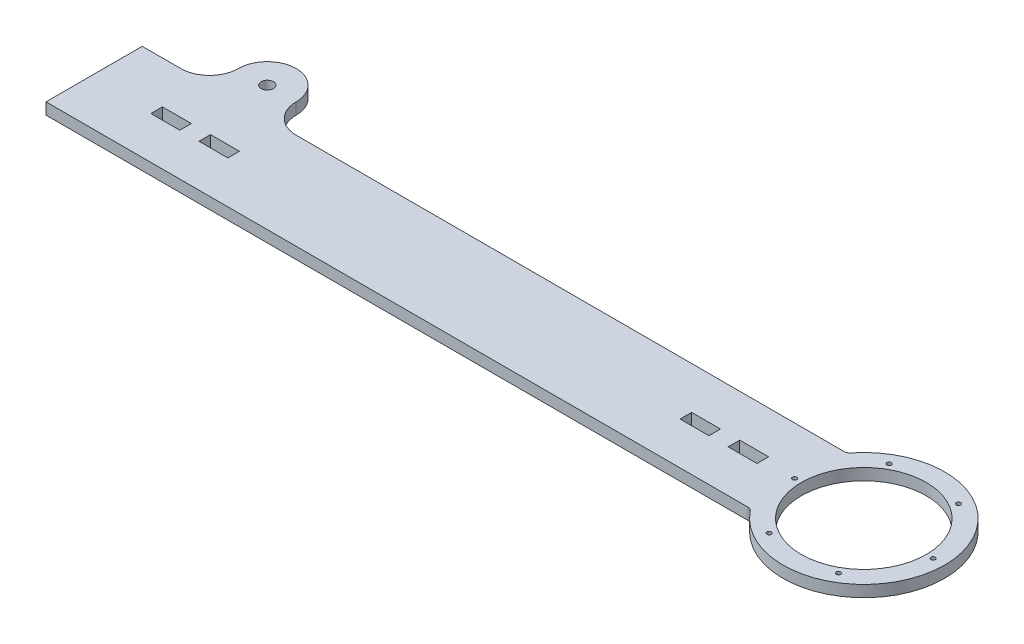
from build123d import *

# Parameters (mm, degrees)
BOSS_EXTRUDE1_DEPTH          = 6
SKETCH2_R                    = 32.45
BEARING_BORE_DEPTH           = 403.243707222
WEB_SLOTS_REACH              = 404.244
SKETCH3_W                    = 15
SKETCH3_H                    = 6
SCREW_HOLE_REACH             = 404.244
SKETCH4_R                    = 1.1303
SCREW_HOLE_DIRECTION_2_DEPTH = 403.243707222
SCREW_PATTERN_COUNT          = 6
FILLET1_R                    = 3
SKETCH5_R                    = 3.175
BOSS_EXTRUDE2_DEPTH          = 6


with BuildPart() as part:
    # Sketch1 → Boss-Extrude1 (new body)
    with BuildSketch(Plane(origin=(0, 0, 0), x_dir=(1, 0, 0), z_dir=(0, 1, 0))):
        with BuildLine():
            Line((-400, 25), (-400, -25))
            Line((-400, -25), (-33.749074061, -25))
            ThreePointArc((-33.749074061, -25), (42, 0), (-33.749074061, 25))
            Line((-33.749074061, 25), (-400, 25))
        make_face()
    extrude(amount=BOSS_EXTRUDE1_DEPTH)

    # Sketch2 → bearing bore (cut, through all)
    with BuildSketch(Plane(origin=(0, 6, 0), x_dir=(1, 0, 0), z_dir=(0, 1, 0))):
        with Locations(Location((0, 0, 0), (0, 0, 270))):
            Circle(SKETCH2_R)
    extrude(amount=-BEARING_BORE_DEPTH, mode=Mode.SUBTRACT)

    # Sketch3 → web slots (cut, up to next)
    with BuildSketch(Plane(origin=(0, 6, 0), x_dir=(1, 0, 0), z_dir=(0, 1, 0)), mode=Mode.PRIVATE) as web_slots_sk1:
        with Locations((-85, 0)):
            Rectangle(SKETCH3_W, SKETCH3_H)
    web_slots_tool1 = extrude(web_slots_sk1.sketch, amount=-WEB_SLOTS_REACH, mode=Mode.PRIVATE) & part.part
    # Sketch3 → web slots (cut, up to next)
    with BuildSketch(Plane(origin=(0, 6, 0), x_dir=(1, 0, 0), z_dir=(0, 1, 0)), mode=Mode.PRIVATE) as web_slots_sk2:
        with Locations((-60, 0)):
            Rectangle(SKETCH3_W, SKETCH3_H)
    web_slots_tool2 = extrude(web_slots_sk2.sketch, amount=-WEB_SLOTS_REACH, mode=Mode.PRIVATE) & part.part
    # Sketch3 → web slots (cut, up to next)
    with BuildSketch(Plane(origin=(0, 6, 0), x_dir=(1, 0, 0), z_dir=(0, 1, 0)), mode=Mode.PRIVATE) as web_slots_sk3:
        with Locations((-335, 0)):
            Rectangle(SKETCH3_W, SKETCH3_H)
    web_slots_tool3 = extrude(web_slots_sk3.sketch, amount=-WEB_SLOTS_REACH, mode=Mode.PRIVATE) & part.part
    # Sketch3 → web slots (cut, up to next)
    with BuildSketch(Plane(origin=(0, 6, 0), x_dir=(1, 0, 0), z_dir=(0, 1, 0)), mode=Mode.PRIVATE) as web_slots_sk4:
        with Locations((-360, 0)):
            Rectangle(SKETCH3_W, SKETCH3_H)
    web_slots_tool4 = extrude(web_slots_sk4.sketch, amount=-WEB_SLOTS_REACH, mode=Mode.PRIVATE) & part.part
    add(web_slots_tool1.solids().sort_by_distance((-85, 6, 0))[0], mode=Mode.SUBTRACT)
    add(web_slots_tool2.solids().sort_by_distance((-60, 6, 0))[0], mode=Mode.SUBTRACT)
    add(web_slots_tool3.solids().sort_by_distance((-335, 6, 0))[0], mode=Mode.SUBTRACT)
    add(web_slots_tool4.solids().sort_by_distance((-360, 6, 0))[0], mode=Mode.SUBTRACT)

    # Sketch4 → screw hole (cut, up to next)
    with BuildSketch(Plane(origin=(0, 6, 0), x_dir=(1, 0, 0), z_dir=(0, 1, 0)), mode=Mode.PRIVATE) as screw_hole_sk1:
        with Locations(Location((36, 0, 0), (0, 0, 90))):
            Circle(SKETCH4_R)
    screw_hole_tool1 = extrude(screw_hole_sk1.sketch, amount=-SCREW_HOLE_REACH, mode=Mode.PRIVATE) & part.part
    screw_hole = screw_hole_tool1.solids().sort_by_distance((36, 6, 0))[0]
    add(screw_hole, mode=Mode.SUBTRACT)

    # Sketch4 → screw hole direction 2 (cut)
    with BuildSketch(Plane(origin=(0, 6, 0), x_dir=(1, 0, 0), z_dir=(0, 1, 0))):
        with Locations(Location((36, 0, 0), (0, 0, 90))):
            Circle(SKETCH4_R)
    screw_hole_direction_2 = extrude(amount=SCREW_HOLE_DIRECTION_2_DEPTH, mode=Mode.SUBTRACT)

    # screw pattern: screw hole, screw hole direction 2 ×6 about axis
    screw_pattern_axis = Axis((0, 0, 0), (0, 1, 0))
    add([screw_hole.rotate(screw_pattern_axis, i * 360 / SCREW_PATTERN_COUNT) for i in range(1, SCREW_PATTERN_COUNT)], mode=Mode.SUBTRACT)
    add([screw_hole_direction_2.rotate(screw_pattern_axis, i * 360 / SCREW_PATTERN_COUNT) for i in range(1, SCREW_PATTERN_COUNT)], mode=Mode.SUBTRACT)

    # Fillet1
    fillet1_edges = [part.edges().sort_by_distance(p)[0] for p in [
        (-33.749074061, 3, -25),
        (-33.749074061, 3, 25),
    ]]
    fillet(fillet1_edges, radius=FILLET1_R)

    # Sketch5 → Boss-Extrude2 (add)
    with BuildSketch(Plane(origin=(0, 6, 0), x_dir=(1, 0, 0), z_dir=(0, 1, 0))):
        with BuildLine():
            Line((-380, 25), (-320, 25))
            ThreePointArc((-320, 25), (-330.606601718, 29.393398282), (-335, 40))
            ThreePointArc((-335, 40), (-350, 55), (-365, 40))
            ThreePointArc((-365, 40), (-369.393398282, 29.393398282), (-380, 25))
        make_face()
        with Locations(Location((-350, 40, 0), (0, 0, 270))):
            Circle(SKETCH5_R, mode=Mode.SUBTRACT)
    extrude(amount=-BOSS_EXTRUDE2_DEPTH)


solid = part.part
